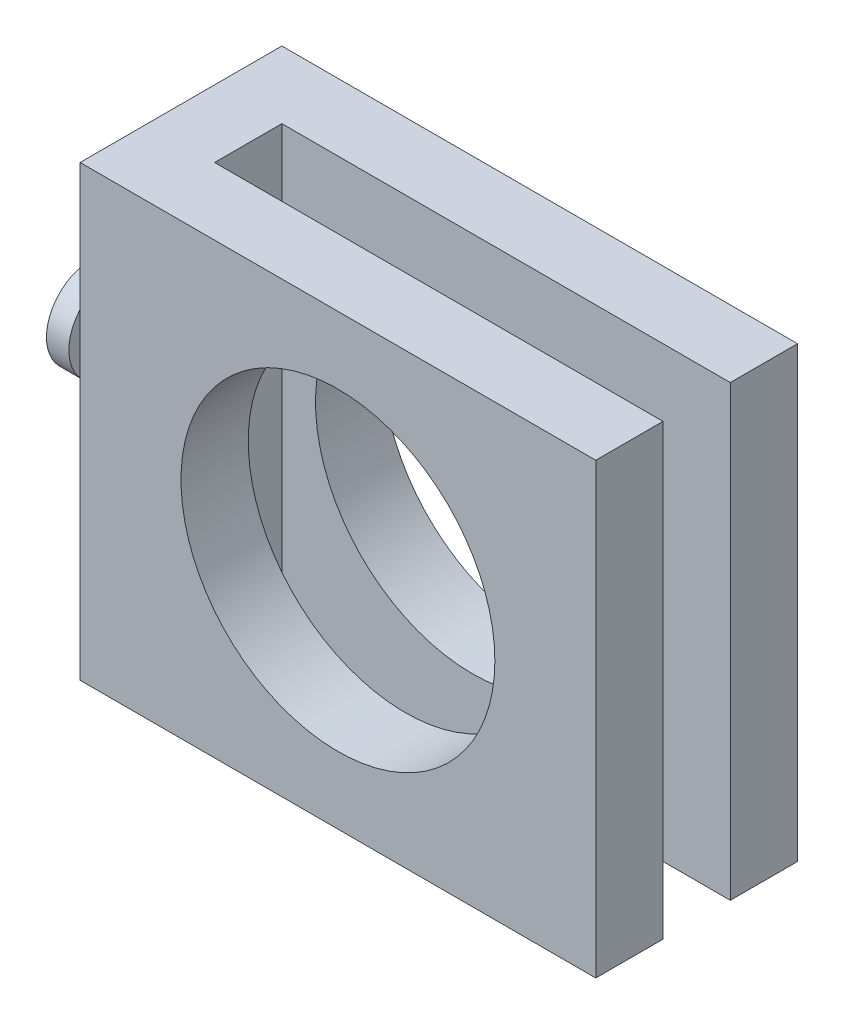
ISO-10303-21;
HEADER;
FILE_DESCRIPTION(('STEP AP214'),'2;1');
FILE_NAME('part.step','',(''),(''),'','','');
FILE_SCHEMA(('AUTOMOTIVE_DESIGN { 1 0 10303 214 1 1 1 1 }'));
ENDSEC;
DATA;
#1=APPLICATION_CONTEXT('core data for automotive mechanical design processes');
#2=APPLICATION_PROTOCOL_DEFINITION('international standard','automotive_design',2000,#1);
#3=PRODUCT_CONTEXT('',#1,'mechanical');
#4=PRODUCT('Part','Part','',(#3));
#5=PRODUCT_RELATED_PRODUCT_CATEGORY('part','',(#4));
#6=PRODUCT_DEFINITION_FORMATION('','',#4);
#7=PRODUCT_DEFINITION_CONTEXT('part definition',#1,'design');
#8=PRODUCT_DEFINITION('design','',#6,#7);
#9=PRODUCT_DEFINITION_SHAPE('','',#8);
#10=(LENGTH_UNIT() NAMED_UNIT(*) SI_UNIT(.MILLI.,.METRE.));
#11=(NAMED_UNIT(*) PLANE_ANGLE_UNIT() SI_UNIT($,.RADIAN.));
#12=(NAMED_UNIT(*) SI_UNIT($,.STERADIAN.) SOLID_ANGLE_UNIT());
#13=UNCERTAINTY_MEASURE_WITH_UNIT(LENGTH_MEASURE(1.E-05),#10,'distance_accuracy_value','');
#14=(GEOMETRIC_REPRESENTATION_CONTEXT(3) GLOBAL_UNCERTAINTY_ASSIGNED_CONTEXT((#13)) GLOBAL_UNIT_ASSIGNED_CONTEXT((#10,
#11,#12)) REPRESENTATION_CONTEXT('',''));
#15=CARTESIAN_POINT('',(0.,0.,0.));
#16=DIRECTION('',(0.,0.,1.));
#17=DIRECTION('',(1.,0.,0.));
#18=AXIS2_PLACEMENT_3D('',#15,#16,#17);
#19=CARTESIAN_POINT('',(10.,-10.,3.));
#20=DIRECTION('',(0.,1.,0.));
#21=DIRECTION('',(-1.,0.,0.));
#22=AXIS2_PLACEMENT_3D('',#19,#20,#21);
#23=PLANE('',#22);
#24=DIRECTION('',(1.,0.,0.));
#25=VECTOR('',#24,1.);
#26=CARTESIAN_POINT('',(10.,-10.,0.));
#27=LINE('',#26,#25);
#28=CARTESIAN_POINT('',(-10.,-10.,0.));
#29=VERTEX_POINT('',#28);
#30=CARTESIAN_POINT('',(10.,-10.,0.));
#31=VERTEX_POINT('',#30);
#32=EDGE_CURVE('E97',#29,#31,#27,.T.);
#33=ORIENTED_EDGE('',*,*,#32,.T.);
#34=DIRECTION('',(0.,0.,-1.));
#35=VECTOR('',#34,1.);
#36=CARTESIAN_POINT('',(10.,-10.,3.));
#37=LINE('',#36,#35);
#38=CARTESIAN_POINT('',(10.,-10.,3.));
#39=VERTEX_POINT('',#38);
#40=EDGE_CURVE('E11',#39,#31,#37,.T.);
#41=ORIENTED_EDGE('',*,*,#40,.F.);
#42=DIRECTION('',(1.,0.,0.));
#43=VECTOR('',#42,1.);
#44=CARTESIAN_POINT('',(10.,-10.,3.));
#45=LINE('',#44,#43);
#46=CARTESIAN_POINT('',(-13.,-10.,3.));
#47=VERTEX_POINT('',#46);
#48=EDGE_CURVE('E91',#47,#39,#45,.T.);
#49=ORIENTED_EDGE('',*,*,#48,.F.);
#50=DIRECTION('',(0.,0.,1.));
#51=VECTOR('',#50,1.);
#52=CARTESIAN_POINT('',(-13.,-10.,-6.));
#53=LINE('',#52,#51);
#54=CARTESIAN_POINT('',(-13.,-10.,-6.));
#55=VERTEX_POINT('',#54);
#56=EDGE_CURVE('E114',#55,#47,#53,.T.);
#57=ORIENTED_EDGE('',*,*,#56,.F.);
#58=DIRECTION('',(1.,0.,0.));
#59=VECTOR('',#58,1.);
#60=CARTESIAN_POINT('',(-13.,-10.,-6.));
#61=LINE('',#60,#59);
#62=CARTESIAN_POINT('',(10.,-10.,-6.));
#63=VERTEX_POINT('',#62);
#64=EDGE_CURVE('E101',#55,#63,#61,.T.);
#65=ORIENTED_EDGE('',*,*,#64,.T.);
#66=DIRECTION('',(0.,0.,-1.));
#67=VECTOR('',#66,1.);
#68=CARTESIAN_POINT('',(10.,-10.,-6.));
#69=LINE('',#68,#67);
#70=CARTESIAN_POINT('',(10.,-10.,-3.));
#71=VERTEX_POINT('',#70);
#72=EDGE_CURVE('E169',#71,#63,#69,.T.);
#73=ORIENTED_EDGE('',*,*,#72,.F.);
#74=DIRECTION('',(1.,0.,0.));
#75=VECTOR('',#74,1.);
#76=CARTESIAN_POINT('',(-10.,-10.,-3.));
#77=LINE('',#76,#75);
#78=CARTESIAN_POINT('',(-10.,-10.,-3.));
#79=VERTEX_POINT('',#78);
#80=EDGE_CURVE('E155',#79,#71,#77,.T.);
#81=ORIENTED_EDGE('',*,*,#80,.F.);
#82=DIRECTION('',(0.,0.,1.));
#83=VECTOR('',#82,1.);
#84=CARTESIAN_POINT('',(-10.,-10.,-6.));
#85=LINE('',#84,#83);
#86=EDGE_CURVE('E109',#79,#29,#85,.T.);
#87=ORIENTED_EDGE('',*,*,#86,.T.);
#88=EDGE_LOOP('',(#33,#41,#49,#57,#65,#73,#81,#87));
#89=FACE_BOUND('',#88,.T.);
#90=ADVANCED_FACE('F45',(#89),#23,.F.);
#91=CARTESIAN_POINT('',(10.,-10.,3.));
#92=DIRECTION('',(-1.,0.,0.));
#93=DIRECTION('',(0.,0.,1.));
#94=AXIS2_PLACEMENT_3D('',#91,#92,#93);
#95=PLANE('',#94);
#96=DIRECTION('',(0.,1.,0.));
#97=VECTOR('',#96,1.);
#98=CARTESIAN_POINT('',(10.,-10.,0.));
#99=LINE('',#98,#97);
#100=CARTESIAN_POINT('',(10.,10.,0.));
#101=VERTEX_POINT('',#100);
#102=EDGE_CURVE('E75',#31,#101,#99,.T.);
#103=ORIENTED_EDGE('',*,*,#102,.T.);
#104=DIRECTION('',(0.,0.,-1.));
#105=VECTOR('',#104,1.);
#106=CARTESIAN_POINT('',(10.,10.,3.));
#107=LINE('',#106,#105);
#108=CARTESIAN_POINT('',(10.,10.,3.));
#109=VERTEX_POINT('',#108);
#110=EDGE_CURVE('E55',#109,#101,#107,.T.);
#111=ORIENTED_EDGE('',*,*,#110,.F.);
#112=DIRECTION('',(0.,1.,0.));
#113=VECTOR('',#112,1.);
#114=CARTESIAN_POINT('',(10.,-10.,3.));
#115=LINE('',#114,#113);
#116=EDGE_CURVE('E63',#39,#109,#115,.T.);
#117=ORIENTED_EDGE('',*,*,#116,.F.);
#118=ORIENTED_EDGE('',*,*,#40,.T.);
#119=EDGE_LOOP('',(#103,#111,#117,#118));
#120=FACE_BOUND('',#119,.T.);
#121=ADVANCED_FACE('F268',(#120),#95,.F.);
#122=CARTESIAN_POINT('',(10.,10.,3.));
#123=DIRECTION('',(0.,-1.,0.));
#124=DIRECTION('',(1.,0.,0.));
#125=AXIS2_PLACEMENT_3D('',#122,#123,#124);
#126=PLANE('',#125);
#127=DIRECTION('',(-1.,0.,0.));
#128=VECTOR('',#127,1.);
#129=CARTESIAN_POINT('',(10.,10.,0.));
#130=LINE('',#129,#128);
#131=CARTESIAN_POINT('',(-10.,10.,0.));
#132=VERTEX_POINT('',#131);
#133=EDGE_CURVE('E81',#101,#132,#130,.T.);
#134=ORIENTED_EDGE('',*,*,#133,.T.);
#135=DIRECTION('',(0.,0.,-1.));
#136=VECTOR('',#135,1.);
#137=CARTESIAN_POINT('',(-10.,10.,-6.));
#138=LINE('',#137,#136);
#139=CARTESIAN_POINT('',(-10.,10.,-3.));
#140=VERTEX_POINT('',#139);
#141=EDGE_CURVE('E87',#132,#140,#138,.T.);
#142=ORIENTED_EDGE('',*,*,#141,.T.);
#143=DIRECTION('',(1.,0.,0.));
#144=VECTOR('',#143,1.);
#145=CARTESIAN_POINT('',(-10.,10.,-3.));
#146=LINE('',#145,#144);
#147=CARTESIAN_POINT('',(10.,10.,-3.));
#148=VERTEX_POINT('',#147);
#149=EDGE_CURVE('E117',#140,#148,#146,.T.);
#150=ORIENTED_EDGE('',*,*,#149,.T.);
#151=DIRECTION('',(0.,0.,1.));
#152=VECTOR('',#151,1.);
#153=CARTESIAN_POINT('',(10.,10.,-6.));
#154=LINE('',#153,#152);
#155=CARTESIAN_POINT('',(10.,10.,-6.));
#156=VERTEX_POINT('',#155);
#157=EDGE_CURVE('E161',#156,#148,#154,.T.);
#158=ORIENTED_EDGE('',*,*,#157,.F.);
#159=DIRECTION('',(1.,0.,0.));
#160=VECTOR('',#159,1.);
#161=CARTESIAN_POINT('',(-13.,10.,-6.));
#162=LINE('',#161,#160);
#163=CARTESIAN_POINT('',(-13.,10.,-6.));
#164=VERTEX_POINT('',#163);
#165=EDGE_CURVE('E121',#164,#156,#162,.T.);
#166=ORIENTED_EDGE('',*,*,#165,.F.);
#167=DIRECTION('',(0.,0.,-1.));
#168=VECTOR('',#167,1.);
#169=CARTESIAN_POINT('',(-13.,10.,-6.));
#170=LINE('',#169,#168);
#171=CARTESIAN_POINT('',(-13.,10.,3.));
#172=VERTEX_POINT('',#171);
#173=EDGE_CURVE('E125',#172,#164,#170,.T.);
#174=ORIENTED_EDGE('',*,*,#173,.F.);
#175=DIRECTION('',(-1.,0.,0.));
#176=VECTOR('',#175,1.);
#177=CARTESIAN_POINT('',(10.,10.,3.));
#178=LINE('',#177,#176);
#179=EDGE_CURVE('E133',#109,#172,#178,.T.);
#180=ORIENTED_EDGE('',*,*,#179,.F.);
#181=ORIENTED_EDGE('',*,*,#110,.T.);
#182=EDGE_LOOP('',(#134,#142,#150,#158,#166,#174,#180,#181));
#183=FACE_BOUND('',#182,.T.);
#184=ADVANCED_FACE('F83',(#183),#126,.F.);
#185=CARTESIAN_POINT('',(0.,0.,3.));
#186=DIRECTION('',(0.,0.,1.));
#187=DIRECTION('',(1.,0.,0.));
#188=AXIS2_PLACEMENT_3D('',#185,#186,#187);
#189=PLANE('',#188);
#190=CARTESIAN_POINT('',(-1.5,0.,3.));
#191=DIRECTION('',(0.,0.,1.));
#192=DIRECTION('',(1.,0.,0.));
#193=AXIS2_PLACEMENT_3D('',#190,#191,#192);
#194=CIRCLE('',#193,7.);
#195=CARTESIAN_POINT('',(5.5,0.,3.));
#196=VERTEX_POINT('',#195);
#197=EDGE_CURVE('E203',#196,#196,#194,.T.);
#198=ORIENTED_EDGE('',*,*,#197,.F.);
#199=EDGE_LOOP('',(#198));
#200=FACE_BOUND('',#199,.T.);
#201=ORIENTED_EDGE('',*,*,#179,.T.);
#202=DIRECTION('',(0.,1.,0.));
#203=VECTOR('',#202,1.);
#204=CARTESIAN_POINT('',(-13.,10.,3.));
#205=LINE('',#204,#203);
#206=EDGE_CURVE('E144',#47,#172,#205,.T.);
#207=ORIENTED_EDGE('',*,*,#206,.F.);
#208=ORIENTED_EDGE('',*,*,#48,.T.);
#209=ORIENTED_EDGE('',*,*,#116,.T.);
#210=EDGE_LOOP('',(#201,#207,#208,#209));
#211=FACE_BOUND('',#210,.T.);
#212=ADVANCED_FACE('F275',(#200,#211),#189,.T.);
#213=CARTESIAN_POINT('',(0.,0.,0.));
#214=DIRECTION('',(0.,0.,1.));
#215=DIRECTION('',(1.,0.,0.));
#216=AXIS2_PLACEMENT_3D('',#213,#214,#215);
#217=PLANE('',#216);
#218=CARTESIAN_POINT('',(-1.5,0.,0.));
#219=DIRECTION('',(0.,0.,1.));
#220=DIRECTION('',(1.,0.,0.));
#221=AXIS2_PLACEMENT_3D('',#218,#219,#220);
#222=CIRCLE('',#221,7.);
#223=CARTESIAN_POINT('',(5.5,0.,0.));
#224=VERTEX_POINT('',#223);
#225=EDGE_CURVE('E192',#224,#224,#222,.T.);
#226=ORIENTED_EDGE('',*,*,#225,.T.);
#227=EDGE_LOOP('',(#226));
#228=FACE_BOUND('',#227,.T.);
#229=DIRECTION('',(0.,-1.,0.));
#230=VECTOR('',#229,1.);
#231=CARTESIAN_POINT('',(-10.,-10.,0.));
#232=LINE('',#231,#230);
#233=EDGE_CURVE('E95',#132,#29,#232,.T.);
#234=ORIENTED_EDGE('',*,*,#233,.F.);
#235=ORIENTED_EDGE('',*,*,#133,.F.);
#236=ORIENTED_EDGE('',*,*,#102,.F.);
#237=ORIENTED_EDGE('',*,*,#32,.F.);
#238=EDGE_LOOP('',(#234,#235,#236,#237));
#239=FACE_BOUND('',#238,.T.);
#240=ADVANCED_FACE('F96',(#228,#239),#217,.F.);
#241=CARTESIAN_POINT('',(-10.,0.,0.));
#242=DIRECTION('',(-1.,0.,0.));
#243=DIRECTION('',(0.,0.,1.));
#244=AXIS2_PLACEMENT_3D('',#241,#242,#243);
#245=PLANE('',#244);
#246=ORIENTED_EDGE('',*,*,#86,.F.);
#247=DIRECTION('',(0.,-1.,0.));
#248=VECTOR('',#247,1.);
#249=CARTESIAN_POINT('',(-10.,10.,-3.));
#250=LINE('',#249,#248);
#251=EDGE_CURVE('E106',#140,#79,#250,.T.);
#252=ORIENTED_EDGE('',*,*,#251,.F.);
#253=ORIENTED_EDGE('',*,*,#141,.F.);
#254=ORIENTED_EDGE('',*,*,#233,.T.);
#255=EDGE_LOOP('',(#246,#252,#253,#254));
#256=FACE_BOUND('',#255,.T.);
#257=ADVANCED_FACE('F104',(#256),#245,.F.);
#258=CARTESIAN_POINT('',(-13.,10.,-6.));
#259=DIRECTION('',(0.,0.,1.));
#260=DIRECTION('',(1.,0.,0.));
#261=AXIS2_PLACEMENT_3D('',#258,#259,#260);
#262=PLANE('',#261);
#263=CARTESIAN_POINT('',(-1.5,0.,-6.));
#264=DIRECTION('',(0.,0.,1.));
#265=DIRECTION('',(1.,0.,0.));
#266=AXIS2_PLACEMENT_3D('',#263,#264,#265);
#267=CIRCLE('',#266,7.);
#268=CARTESIAN_POINT('',(5.5,0.,-6.));
#269=VERTEX_POINT('',#268);
#270=EDGE_CURVE('E199',#269,#269,#267,.T.);
#271=ORIENTED_EDGE('',*,*,#270,.T.);
#272=EDGE_LOOP('',(#271));
#273=FACE_BOUND('',#272,.T.);
#274=ORIENTED_EDGE('',*,*,#165,.T.);
#275=DIRECTION('',(0.,1.,0.));
#276=VECTOR('',#275,1.);
#277=CARTESIAN_POINT('',(10.,10.,-6.));
#278=LINE('',#277,#276);
#279=EDGE_CURVE('E165',#63,#156,#278,.T.);
#280=ORIENTED_EDGE('',*,*,#279,.F.);
#281=ORIENTED_EDGE('',*,*,#64,.F.);
#282=DIRECTION('',(0.,-1.,0.));
#283=VECTOR('',#282,1.);
#284=CARTESIAN_POINT('',(-13.,10.,-6.));
#285=LINE('',#284,#283);
#286=EDGE_CURVE('E108',#164,#55,#285,.T.);
#287=ORIENTED_EDGE('',*,*,#286,.F.);
#288=EDGE_LOOP('',(#274,#280,#281,#287));
#289=FACE_BOUND('',#288,.T.);
#290=ADVANCED_FACE('F254',(#273,#289),#262,.F.);
#291=CARTESIAN_POINT('',(-13.,0.,0.));
#292=DIRECTION('',(-1.,0.,0.));
#293=DIRECTION('',(0.,0.,1.));
#294=AXIS2_PLACEMENT_3D('',#291,#292,#293);
#295=PLANE('',#294);
#296=CARTESIAN_POINT('',(-13.,0.,-1.5));
#297=DIRECTION('',(-1.,0.,0.));
#298=DIRECTION('',(0.,0.,1.));
#299=AXIS2_PLACEMENT_3D('',#296,#297,#298);
#300=CIRCLE('',#299,1.5);
#301=CARTESIAN_POINT('',(-13.,0.,0.));
#302=VERTEX_POINT('',#301);
#303=EDGE_CURVE('E180',#302,#302,#300,.T.);
#304=ORIENTED_EDGE('',*,*,#303,.F.);
#305=EDGE_LOOP('',(#304));
#306=FACE_BOUND('',#305,.T.);
#307=ORIENTED_EDGE('',*,*,#286,.T.);
#308=ORIENTED_EDGE('',*,*,#56,.T.);
#309=ORIENTED_EDGE('',*,*,#206,.T.);
#310=ORIENTED_EDGE('',*,*,#173,.T.);
#311=EDGE_LOOP('',(#307,#308,#309,#310));
#312=FACE_BOUND('',#311,.T.);
#313=ADVANCED_FACE('F219',(#306,#312),#295,.T.);
#314=CARTESIAN_POINT('',(-10.,10.,-3.));
#315=DIRECTION('',(0.,0.,1.));
#316=DIRECTION('',(0.,-1.,0.));
#317=AXIS2_PLACEMENT_3D('',#314,#315,#316);
#318=PLANE('',#317);
#319=CARTESIAN_POINT('',(-1.5,0.,-3.));
#320=DIRECTION('',(0.,0.,1.));
#321=DIRECTION('',(0.,-1.,0.));
#322=AXIS2_PLACEMENT_3D('',#319,#320,#321);
#323=CIRCLE('',#322,7.);
#324=CARTESIAN_POINT('',(-1.5,-7.,-3.));
#325=VERTEX_POINT('',#324);
#326=EDGE_CURVE('E48',#325,#325,#323,.T.);
#327=ORIENTED_EDGE('',*,*,#326,.F.);
#328=EDGE_LOOP('',(#327));
#329=FACE_BOUND('',#328,.T.);
#330=DIRECTION('',(0.,-1.,0.));
#331=VECTOR('',#330,1.);
#332=CARTESIAN_POINT('',(10.,10.,-3.));
#333=LINE('',#332,#331);
#334=EDGE_CURVE('E173',#148,#71,#333,.T.);
#335=ORIENTED_EDGE('',*,*,#334,.F.);
#336=ORIENTED_EDGE('',*,*,#149,.F.);
#337=ORIENTED_EDGE('',*,*,#251,.T.);
#338=ORIENTED_EDGE('',*,*,#80,.T.);
#339=EDGE_LOOP('',(#335,#336,#337,#338));
#340=FACE_BOUND('',#339,.T.);
#341=ADVANCED_FACE('F215',(#329,#340),#318,.T.);
#342=CARTESIAN_POINT('',(10.,0.,0.));
#343=DIRECTION('',(-1.,0.,0.));
#344=DIRECTION('',(0.,0.,1.));
#345=AXIS2_PLACEMENT_3D('',#342,#343,#344);
#346=PLANE('',#345);
#347=ORIENTED_EDGE('',*,*,#334,.T.);
#348=ORIENTED_EDGE('',*,*,#72,.T.);
#349=ORIENTED_EDGE('',*,*,#279,.T.);
#350=ORIENTED_EDGE('',*,*,#157,.T.);
#351=EDGE_LOOP('',(#347,#348,#349,#350));
#352=FACE_BOUND('',#351,.T.);
#353=ADVANCED_FACE('F218',(#352),#346,.F.);
#354=CARTESIAN_POINT('',(-16.,0.,-1.5));
#355=DIRECTION('',(1.,0.,0.));
#356=DIRECTION('',(0.,0.,-1.));
#357=AXIS2_PLACEMENT_3D('',#354,#355,#356);
#358=CYLINDRICAL_SURFACE('',#357,1.5);
#359=CARTESIAN_POINT('',(-16.,0.,-1.5));
#360=DIRECTION('',(-1.,0.,0.));
#361=DIRECTION('',(0.,0.,1.));
#362=AXIS2_PLACEMENT_3D('',#359,#360,#361);
#363=CIRCLE('',#362,1.5);
#364=CARTESIAN_POINT('',(-16.,0.,0.));
#365=VERTEX_POINT('',#364);
#366=EDGE_CURVE('E177',#365,#365,#363,.T.);
#367=ORIENTED_EDGE('',*,*,#366,.F.);
#368=EDGE_LOOP('',(#367));
#369=FACE_BOUND('',#368,.T.);
#370=ORIENTED_EDGE('',*,*,#303,.T.);
#371=EDGE_LOOP('',(#370));
#372=FACE_BOUND('',#371,.T.);
#373=ADVANCED_FACE('F314',(#369,#372),#358,.T.);
#374=CARTESIAN_POINT('',(-17.,0.,-1.5));
#375=DIRECTION('',(1.,0.,0.));
#376=DIRECTION('',(0.,0.,-1.));
#377=AXIS2_PLACEMENT_3D('',#374,#375,#376);
#378=CYLINDRICAL_SURFACE('',#377,2.);
#379=CARTESIAN_POINT('',(-17.,0.,-1.5));
#380=DIRECTION('',(-1.,0.,0.));
#381=DIRECTION('',(0.,0.,1.));
#382=AXIS2_PLACEMENT_3D('',#379,#380,#381);
#383=CIRCLE('',#382,2.);
#384=CARTESIAN_POINT('',(-17.,0.,0.5));
#385=VERTEX_POINT('',#384);
#386=EDGE_CURVE('E184',#385,#385,#383,.T.);
#387=ORIENTED_EDGE('',*,*,#386,.F.);
#388=EDGE_LOOP('',(#387));
#389=FACE_BOUND('',#388,.T.);
#390=CARTESIAN_POINT('',(-16.,0.,-1.5));
#391=DIRECTION('',(-1.,0.,0.));
#392=DIRECTION('',(0.,0.,1.));
#393=AXIS2_PLACEMENT_3D('',#390,#391,#392);
#394=CIRCLE('',#393,2.);
#395=CARTESIAN_POINT('',(-16.,0.,0.5));
#396=VERTEX_POINT('',#395);
#397=EDGE_CURVE('E188',#396,#396,#394,.T.);
#398=ORIENTED_EDGE('',*,*,#397,.T.);
#399=EDGE_LOOP('',(#398));
#400=FACE_BOUND('',#399,.T.);
#401=ADVANCED_FACE('F355',(#389,#400),#378,.T.);
#402=CARTESIAN_POINT('',(-17.,0.,-1.5));
#403=DIRECTION('',(-1.,0.,0.));
#404=DIRECTION('',(0.,0.,1.));
#405=AXIS2_PLACEMENT_3D('',#402,#403,#404);
#406=PLANE('',#405);
#407=ORIENTED_EDGE('',*,*,#386,.T.);
#408=EDGE_LOOP('',(#407));
#409=FACE_BOUND('',#408,.T.);
#410=ADVANCED_FACE('F363',(#409),#406,.T.);
#411=CARTESIAN_POINT('',(-16.,0.,-1.5));
#412=DIRECTION('',(-1.,0.,0.));
#413=DIRECTION('',(0.,0.,1.));
#414=AXIS2_PLACEMENT_3D('',#411,#412,#413);
#415=PLANE('',#414);
#416=ORIENTED_EDGE('',*,*,#366,.T.);
#417=EDGE_LOOP('',(#416));
#418=FACE_BOUND('',#417,.T.);
#419=ORIENTED_EDGE('',*,*,#397,.F.);
#420=EDGE_LOOP('',(#419));
#421=FACE_BOUND('',#420,.T.);
#422=ADVANCED_FACE('F289',(#418,#421),#415,.F.);
#423=CARTESIAN_POINT('',(-1.5,0.,-7.));
#424=DIRECTION('',(0.,0.,1.));
#425=DIRECTION('',(1.,0.,0.));
#426=AXIS2_PLACEMENT_3D('',#423,#424,#425);
#427=CYLINDRICAL_SURFACE('',#426,7.);
#428=ORIENTED_EDGE('',*,*,#326,.T.);
#429=EDGE_LOOP('',(#428));
#430=FACE_BOUND('',#429,.T.);
#431=ORIENTED_EDGE('',*,*,#270,.F.);
#432=EDGE_LOOP('',(#431));
#433=FACE_BOUND('',#432,.T.);
#434=ADVANCED_FACE('F212',(#430,#433),#427,.F.);
#435=ORIENTED_EDGE('',*,*,#197,.T.);
#436=EDGE_LOOP('',(#435));
#437=FACE_BOUND('',#436,.T.);
#438=ORIENTED_EDGE('',*,*,#225,.F.);
#439=EDGE_LOOP('',(#438));
#440=FACE_BOUND('',#439,.T.);
#441=ADVANCED_FACE('F389',(#437,#440),#427,.F.);
#442=CLOSED_SHELL('',(#90,#121,#184,#212,#240,#257,#290,#313,#341,#353,#373,#401,#410,#422,#434,#441));
#443=MANIFOLD_SOLID_BREP('B2',#442);
#444=ADVANCED_BREP_SHAPE_REPRESENTATION('',(#18,#443),#14);
#445=SHAPE_DEFINITION_REPRESENTATION(#9,#444);
ENDSEC;
END-ISO-10303-21;
